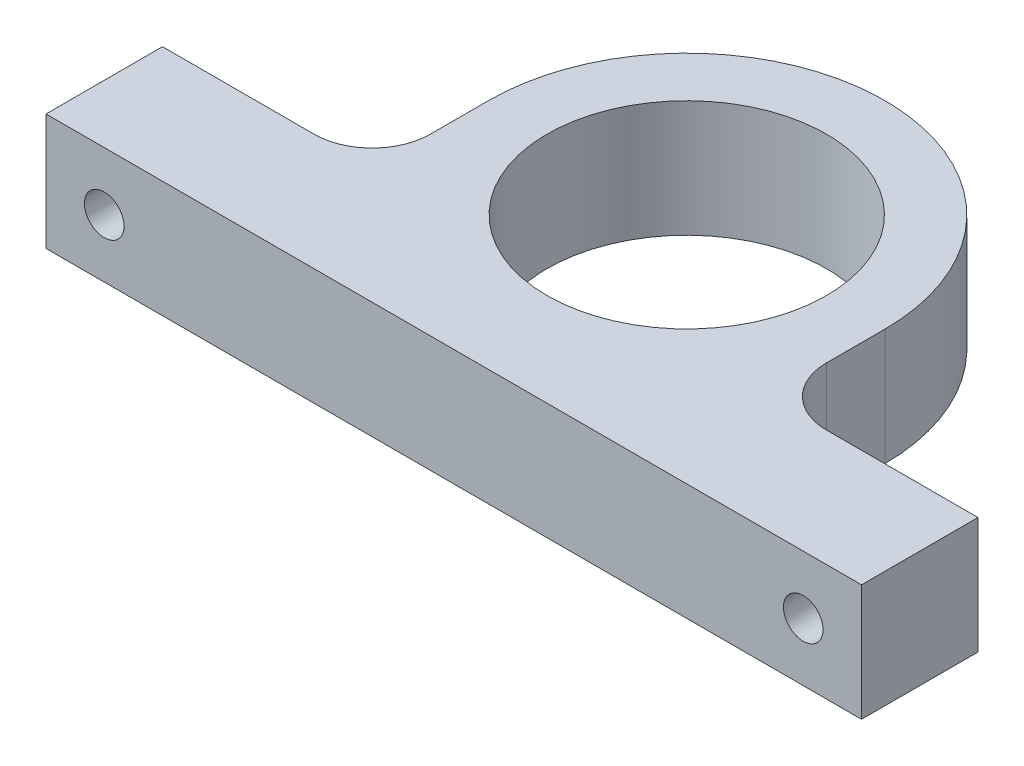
from build123d import *

# Parameters (mm, degrees)
SKETCH1_R                                       = 12
BOSS_EXTRUDE1_DEPTH                             = 10
FILLET1_R                                       = 5
CSK_FOR_M3_FLAT_HEAD_MACHINE_SCREW1_D           = 3.4
CSK_FOR_M3_FLAT_HEAD_MACHINE_SCREW1_CSINK_D     = 6.3
CSK_FOR_M3_FLAT_HEAD_MACHINE_SCREW1_CSINK_ANGLE = 90


with BuildPart() as part:
    # Sketch1 → Boss-Extrude1 (new body)
    with BuildSketch(Plane(origin=(0, 0, 0), x_dir=(1, 0, 0), z_dir=(0, 1, 0))):
        with BuildLine():
            Line((35, 0), (-35, 0))
            Line((-35, 0), (-35, 10))
            Line((-35, 10), (-17, 10))
            Line((-17, 10), (-17, 20))
            ThreePointArc((-17, 20), (0, 37), (17, 20))
            Line((17, 20), (17, 10))
            Line((17, 10), (35, 10))
            Line((35, 10), (35, 0))
        make_face()
        with Locations(Location((0, 20, 0), (0, 0, 270))):
            Circle(SKETCH1_R, mode=Mode.SUBTRACT)
    extrude(amount=BOSS_EXTRUDE1_DEPTH)

    # Fillet1
    fillet1_edges = [part.edges().sort_by_distance(p)[0] for p in [
        (17, 5, -10),
        (-17, 5, -10),
    ]]
    fillet(fillet1_edges, radius=FILLET1_R)

    # CSK for M3 Flat Head Machine Screw1 (through all)
    with Locations(Plane(origin=(30, 5, -10), x_dir=(-1, 0, 0), z_dir=(0, 0, -1))):
        with Locations((0, 0), (60, 0)):
            CounterSinkHole(CSK_FOR_M3_FLAT_HEAD_MACHINE_SCREW1_D / 2, CSK_FOR_M3_FLAT_HEAD_MACHINE_SCREW1_CSINK_D / 2, counter_sink_angle=CSK_FOR_M3_FLAT_HEAD_MACHINE_SCREW1_CSINK_ANGLE)


solid = part.part
